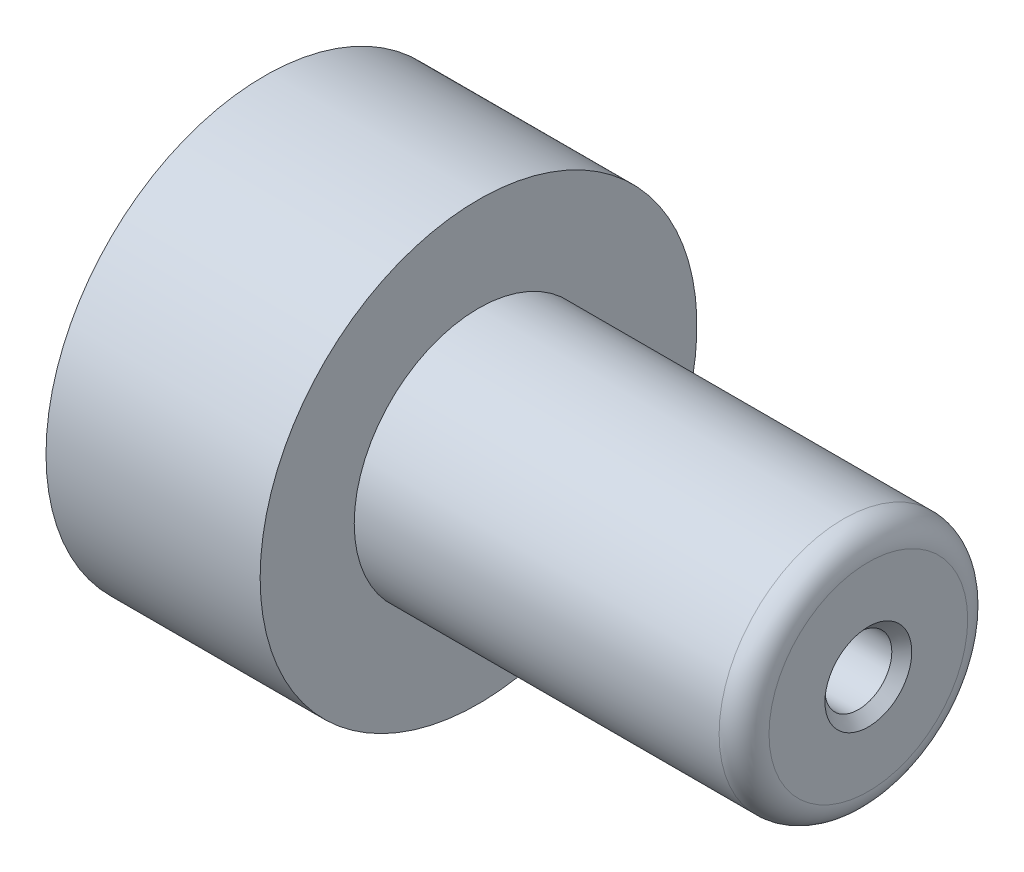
from build123d import *

# Parameters (mm, degrees)
SKETCH2_R          = 1.2065
CUT_EXTRUDE1_DEPTH = 2.54
SKETCH3_R          = 1.7018
CUT_EXTRUDE2_DEPTH = 35.51889437
CHAMFER1_SIZE      = 0.508


with BuildPart() as part:
    # Sketch1 → Revolve1 (revolve)
    with BuildSketch(Plane.XY, mode=Mode.PRIVATE) as revolve1_sk:
        with BuildLine():
            Line((0, 3.9751), (0, 11.1125))
            Line((0, 11.1125), (10.8966, 11.1125))
            Line((10.8966, 11.1125), (10.8966, 6.3246))
            Line((10.8966, 6.3246), (29.464, 6.3246))
            ThreePointArc((29.464, 6.3246), (30.362025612, 5.952625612), (30.734, 5.0546))
            Line((30.734, 5.0546), (30.734, 0))
            Line((30.734, 0), (21.8948, 0))
            Line((21.8948, 0), (21.8948, 3.9751))
            Line((21.8948, 3.9751), (0, 3.9751))
        make_face()
    revolve(revolve1_sk.sketch.rotate(Axis((0, 0, 0), (1, 0, 0)), 90), axis=Axis((0, 0, 0), (1, 0, 0)))

    # Sketch2 → Cut-Extrude1 (cut)
    with BuildSketch(Plane.ZY):
        with Locations((-6.7437, 0)):
            Circle(SKETCH2_R)
        with Locations(Location((6.7437, 0, 0), (0, 0, 180))):
            Circle(SKETCH2_R)
    extrude(amount=-CUT_EXTRUDE1_DEPTH, mode=Mode.SUBTRACT)

    # Sketch3 → Cut-Extrude2 (cut, through all)
    with BuildSketch(Plane(origin=(30.734, 0, 0), x_dir=(0, 0, -1), z_dir=(1, 0, 0))):
        Circle(SKETCH3_R)
    extrude(amount=-CUT_EXTRUDE2_DEPTH, mode=Mode.SUBTRACT)

    # Chamfer1
    chamfer1_edges = [part.edges().sort_by_distance(p)[0] for p in [
        (30.734, 0, 1.7018),
    ]]
    chamfer(chamfer1_edges, length=CHAMFER1_SIZE)


solid = part.part
